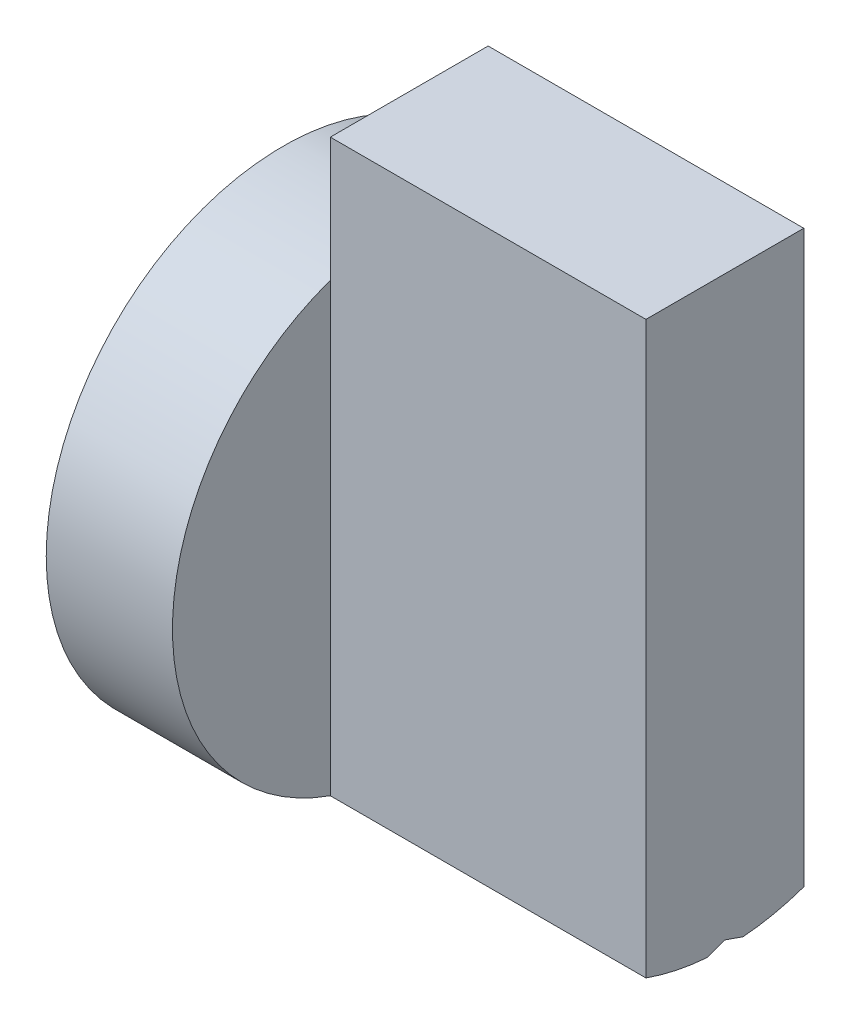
ISO-10303-21;
HEADER;
FILE_DESCRIPTION(('STEP AP214'),'2;1');
FILE_NAME('part.step','',(''),(''),'','','');
FILE_SCHEMA(('AUTOMOTIVE_DESIGN { 1 0 10303 214 1 1 1 1 }'));
ENDSEC;
DATA;
#1=APPLICATION_CONTEXT('core data for automotive mechanical design processes');
#2=APPLICATION_PROTOCOL_DEFINITION('international standard','automotive_design',2000,#1);
#3=PRODUCT_CONTEXT('',#1,'mechanical');
#4=PRODUCT('Part','Part','',(#3));
#5=PRODUCT_RELATED_PRODUCT_CATEGORY('part','',(#4));
#6=PRODUCT_DEFINITION_FORMATION('','',#4);
#7=PRODUCT_DEFINITION_CONTEXT('part definition',#1,'design');
#8=PRODUCT_DEFINITION('design','',#6,#7);
#9=PRODUCT_DEFINITION_SHAPE('','',#8);
#10=(LENGTH_UNIT() NAMED_UNIT(*) SI_UNIT(.MILLI.,.METRE.));
#11=(NAMED_UNIT(*) PLANE_ANGLE_UNIT() SI_UNIT($,.RADIAN.));
#12=(NAMED_UNIT(*) SI_UNIT($,.STERADIAN.) SOLID_ANGLE_UNIT());
#13=UNCERTAINTY_MEASURE_WITH_UNIT(LENGTH_MEASURE(1.E-05),#10,'distance_accuracy_value','');
#14=(GEOMETRIC_REPRESENTATION_CONTEXT(3) GLOBAL_UNCERTAINTY_ASSIGNED_CONTEXT((#13)) GLOBAL_UNIT_ASSIGNED_CONTEXT((#10,
#11,#12)) REPRESENTATION_CONTEXT('',''));
#15=CARTESIAN_POINT('',(0.,0.,0.));
#16=DIRECTION('',(0.,0.,1.));
#17=DIRECTION('',(1.,0.,0.));
#18=AXIS2_PLACEMENT_3D('',#15,#16,#17);
#19=CARTESIAN_POINT('',(0.,0.,0.));
#20=DIRECTION('',(1.,0.,0.));
#21=DIRECTION('',(0.,0.,-1.));
#22=AXIS2_PLACEMENT_3D('',#19,#20,#21);
#23=PLANE('',#22);
#24=CARTESIAN_POINT('',(0.,0.,0.));
#25=DIRECTION('',(1.,0.,0.));
#26=DIRECTION('',(0.,0.,-1.));
#27=AXIS2_PLACEMENT_3D('',#24,#25,#26);
#28=CIRCLE('',#27,7.5);
#29=CARTESIAN_POINT('',(0.,0.,-7.5));
#30=VERTEX_POINT('',#29);
#31=EDGE_CURVE('E165',#30,#30,#28,.T.);
#32=ORIENTED_EDGE('',*,*,#31,.F.);
#33=EDGE_LOOP('',(#32));
#34=FACE_BOUND('',#33,.T.);
#35=ADVANCED_FACE('F16',(#34),#23,.F.);
#36=CARTESIAN_POINT('',(4.,-7.276185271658,0.));
#37=DIRECTION('',(0.,-0.942885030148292,0.333118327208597));
#38=DIRECTION('',(0.,-0.333118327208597,-0.942885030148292));
#39=AXIS2_PLACEMENT_3D('',#36,#37,#38);
#40=PLANE('',#39);
#41=DIRECTION('',(1.,0.,0.));
#42=VECTOR('',#41,1.);
#43=CARTESIAN_POINT('',(4.,-7.27618527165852,-1.82254385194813E-13));
#44=LINE('',#43,#42);
#45=CARTESIAN_POINT('',(4.,-7.27618527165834,-1.21502923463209E-13));
#46=VERTEX_POINT('',#45);
#47=CARTESIAN_POINT('',(14.,-7.27618527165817,0.));
#48=VERTEX_POINT('',#47);
#49=EDGE_CURVE('E85',#46,#48,#44,.T.);
#50=ORIENTED_EDGE('',*,*,#49,.F.);
#51=DIRECTION('',(0.,0.333118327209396,0.94288503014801));
#52=VECTOR('',#51,1.);
#53=CARTESIAN_POINT('',(4.,-7.478176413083,-0.5717320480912));
#54=LINE('',#53,#52);
#55=CARTESIAN_POINT('',(4.,-7.47817641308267,-0.571732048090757));
#56=VERTEX_POINT('',#55);
#57=EDGE_CURVE('E95',#56,#46,#54,.T.);
#58=ORIENTED_EDGE('',*,*,#57,.F.);
#59=DIRECTION('',(1.,0.,0.));
#60=VECTOR('',#59,1.);
#61=CARTESIAN_POINT('',(0.,-7.47817641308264,-0.571732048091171));
#62=LINE('',#61,#60);
#63=CARTESIAN_POINT('',(14.,-7.47817641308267,-0.571732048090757));
#64=VERTEX_POINT('',#63);
#65=EDGE_CURVE('E101',#64,#56,#62,.F.);
#66=ORIENTED_EDGE('',*,*,#65,.F.);
#67=DIRECTION('',(0.,-0.333118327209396,-0.94288503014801));
#68=VECTOR('',#67,1.);
#69=CARTESIAN_POINT('',(14.,-7.276185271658,0.));
#70=LINE('',#69,#68);
#71=EDGE_CURVE('E98',#48,#64,#70,.T.);
#72=ORIENTED_EDGE('',*,*,#71,.F.);
#73=EDGE_LOOP('',(#50,#58,#66,#72));
#74=FACE_BOUND('',#73,.T.);
#75=ADVANCED_FACE('F99',(#74),#40,.T.);
#76=CARTESIAN_POINT('',(4.,0.,0.));
#77=DIRECTION('',(1.,0.,0.));
#78=DIRECTION('',(0.,0.,-1.));
#79=AXIS2_PLACEMENT_3D('',#76,#77,#78);
#80=PLANE('',#79);
#81=DIRECTION('',(0.,0.333118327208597,-0.942885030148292));
#82=VECTOR('',#81,1.);
#83=CARTESIAN_POINT('',(4.,-7.478176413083,0.5717320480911));
#84=LINE('',#83,#82);
#85=CARTESIAN_POINT('',(4.,-7.47817641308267,0.571732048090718));
#86=VERTEX_POINT('',#85);
#87=EDGE_CURVE('E92',#86,#46,#84,.T.);
#88=ORIENTED_EDGE('',*,*,#87,.F.);
#89=CARTESIAN_POINT('',(4.,0.,0.));
#90=DIRECTION('',(1.,0.,0.));
#91=DIRECTION('',(0.,0.,-1.));
#92=AXIS2_PLACEMENT_3D('',#89,#90,#91);
#93=CIRCLE('',#92,7.5);
#94=EDGE_CURVE('E146',#56,#86,#93,.F.);
#95=ORIENTED_EDGE('',*,*,#94,.F.);
#96=ORIENTED_EDGE('',*,*,#57,.T.);
#97=EDGE_LOOP('',(#88,#95,#96));
#98=FACE_BOUND('',#97,.T.);
#99=ADVANCED_FACE('F195',(#98),#80,.T.);
#100=CARTESIAN_POINT('',(4.,-7.478176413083,0.5717320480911));
#101=DIRECTION('',(0.,-0.942885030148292,-0.333118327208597));
#102=DIRECTION('',(0.,0.333118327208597,-0.942885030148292));
#103=AXIS2_PLACEMENT_3D('',#100,#101,#102);
#104=PLANE('',#103);
#105=DIRECTION('',(1.,0.,0.));
#106=VECTOR('',#105,1.);
#107=CARTESIAN_POINT('',(0.,-7.47817641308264,0.571732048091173));
#108=LINE('',#107,#106);
#109=CARTESIAN_POINT('',(14.,-7.47817641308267,0.571732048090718));
#110=VERTEX_POINT('',#109);
#111=EDGE_CURVE('E144',#86,#110,#108,.T.);
#112=ORIENTED_EDGE('',*,*,#111,.F.);
#113=ORIENTED_EDGE('',*,*,#87,.T.);
#114=ORIENTED_EDGE('',*,*,#49,.T.);
#115=DIRECTION('',(0.,0.333118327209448,-0.942885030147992));
#116=VECTOR('',#115,1.);
#117=CARTESIAN_POINT('',(14.,-7.478176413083,0.5717320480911));
#118=LINE('',#117,#116);
#119=EDGE_CURVE('E90',#110,#48,#118,.T.);
#120=ORIENTED_EDGE('',*,*,#119,.F.);
#121=EDGE_LOOP('',(#112,#113,#114,#120));
#122=FACE_BOUND('',#121,.T.);
#123=ADVANCED_FACE('F88',(#122),#104,.T.);
#124=CARTESIAN_POINT('',(4.,11.,2.5));
#125=DIRECTION('',(0.,0.,1.));
#126=DIRECTION('',(1.,0.,0.));
#127=AXIS2_PLACEMENT_3D('',#124,#125,#126);
#128=PLANE('',#127);
#129=DIRECTION('',(1.,0.,0.));
#130=VECTOR('',#129,1.);
#131=CARTESIAN_POINT('',(0.,-7.07106781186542,2.50000000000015));
#132=LINE('',#131,#130);
#133=CARTESIAN_POINT('',(14.,-7.07106781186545,2.50000000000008));
#134=VERTEX_POINT('',#133);
#135=CARTESIAN_POINT('',(4.,-7.07106781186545,2.50000000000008));
#136=VERTEX_POINT('',#135);
#137=EDGE_CURVE('E140',#134,#136,#132,.F.);
#138=ORIENTED_EDGE('',*,*,#137,.F.);
#139=DIRECTION('',(0.,1.,0.));
#140=VECTOR('',#139,1.);
#141=CARTESIAN_POINT('',(14.,0.,2.5));
#142=LINE('',#141,#140);
#143=CARTESIAN_POINT('',(14.,11.,2.5));
#144=VERTEX_POINT('',#143);
#145=EDGE_CURVE('E120',#144,#134,#142,.F.);
#146=ORIENTED_EDGE('',*,*,#145,.F.);
#147=DIRECTION('',(1.,0.,0.));
#148=VECTOR('',#147,1.);
#149=CARTESIAN_POINT('',(4.,11.,2.5));
#150=LINE('',#149,#148);
#151=CARTESIAN_POINT('',(4.,11.,2.5));
#152=VERTEX_POINT('',#151);
#153=EDGE_CURVE('E112',#152,#144,#150,.T.);
#154=ORIENTED_EDGE('',*,*,#153,.F.);
#155=DIRECTION('',(0.,1.,0.));
#156=VECTOR('',#155,1.);
#157=CARTESIAN_POINT('',(4.,0.,2.5));
#158=LINE('',#157,#156);
#159=CARTESIAN_POINT('',(4.,7.07106781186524,2.5));
#160=VERTEX_POINT('',#159);
#161=EDGE_CURVE('E132',#152,#160,#158,.F.);
#162=ORIENTED_EDGE('',*,*,#161,.T.);
#163=DIRECTION('',(0.,1.,0.));
#164=VECTOR('',#163,1.);
#165=CARTESIAN_POINT('',(4.,0.,2.5));
#166=LINE('',#165,#164);
#167=EDGE_CURVE('E137',#136,#160,#166,.T.);
#168=ORIENTED_EDGE('',*,*,#167,.F.);
#169=EDGE_LOOP('',(#138,#146,#154,#162,#168));
#170=FACE_BOUND('',#169,.T.);
#171=ADVANCED_FACE('F191',(#170),#128,.T.);
#172=CARTESIAN_POINT('',(4.,0.,0.));
#173=DIRECTION('',(1.,0.,0.));
#174=DIRECTION('',(0.,0.,-1.));
#175=AXIS2_PLACEMENT_3D('',#172,#173,#174);
#176=PLANE('',#175);
#177=CARTESIAN_POINT('',(4.,0.,0.));
#178=DIRECTION('',(1.,0.,0.));
#179=DIRECTION('',(0.,0.,-1.));
#180=AXIS2_PLACEMENT_3D('',#177,#178,#179);
#181=CIRCLE('',#180,7.5);
#182=EDGE_CURVE('E143',#136,#160,#181,.F.);
#183=ORIENTED_EDGE('',*,*,#182,.F.);
#184=ORIENTED_EDGE('',*,*,#167,.T.);
#185=EDGE_LOOP('',(#183,#184));
#186=FACE_BOUND('',#185,.T.);
#187=ADVANCED_FACE('F197',(#186),#176,.T.);
#188=CARTESIAN_POINT('',(4.,0.,0.));
#189=DIRECTION('',(1.,0.,0.));
#190=DIRECTION('',(0.,0.,-1.));
#191=AXIS2_PLACEMENT_3D('',#188,#189,#190);
#192=PLANE('',#191);
#193=DIRECTION('',(0.,0.,1.));
#194=VECTOR('',#193,1.);
#195=CARTESIAN_POINT('',(4.,11.,-2.5));
#196=LINE('',#195,#194);
#197=CARTESIAN_POINT('',(4.,11.,-2.5));
#198=VERTEX_POINT('',#197);
#199=EDGE_CURVE('E71',#198,#152,#196,.T.);
#200=ORIENTED_EDGE('',*,*,#199,.F.);
#201=DIRECTION('',(0.,1.,0.));
#202=VECTOR('',#201,1.);
#203=CARTESIAN_POINT('',(4.,-5.,-2.5));
#204=LINE('',#203,#202);
#205=CARTESIAN_POINT('',(4.,7.07106781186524,-2.5));
#206=VERTEX_POINT('',#205);
#207=EDGE_CURVE('E127',#206,#198,#204,.T.);
#208=ORIENTED_EDGE('',*,*,#207,.F.);
#209=CARTESIAN_POINT('',(4.,0.,0.));
#210=DIRECTION('',(1.,0.,0.));
#211=DIRECTION('',(0.,0.,-1.));
#212=AXIS2_PLACEMENT_3D('',#209,#210,#211);
#213=CIRCLE('',#212,7.5);
#214=EDGE_CURVE('E19',#160,#206,#213,.F.);
#215=ORIENTED_EDGE('',*,*,#214,.F.);
#216=ORIENTED_EDGE('',*,*,#161,.F.);
#217=EDGE_LOOP('',(#200,#208,#215,#216));
#218=FACE_BOUND('',#217,.T.);
#219=ADVANCED_FACE('F198',(#218),#192,.F.);
#220=CARTESIAN_POINT('',(4.,11.,-2.5));
#221=DIRECTION('',(0.,1.,0.));
#222=DIRECTION('',(0.,0.,1.));
#223=AXIS2_PLACEMENT_3D('',#220,#221,#222);
#224=PLANE('',#223);
#225=DIRECTION('',(-1.,0.,0.));
#226=VECTOR('',#225,1.);
#227=CARTESIAN_POINT('',(4.,11.,-2.5));
#228=LINE('',#227,#226);
#229=CARTESIAN_POINT('',(14.,11.,-2.5));
#230=VERTEX_POINT('',#229);
#231=EDGE_CURVE('E123',#198,#230,#228,.F.);
#232=ORIENTED_EDGE('',*,*,#231,.F.);
#233=ORIENTED_EDGE('',*,*,#199,.T.);
#234=ORIENTED_EDGE('',*,*,#153,.T.);
#235=DIRECTION('',(0.,0.,-1.));
#236=VECTOR('',#235,1.);
#237=CARTESIAN_POINT('',(14.,11.,0.));
#238=LINE('',#237,#236);
#239=EDGE_CURVE('E104',#230,#144,#238,.F.);
#240=ORIENTED_EDGE('',*,*,#239,.F.);
#241=EDGE_LOOP('',(#232,#233,#234,#240));
#242=FACE_BOUND('',#241,.T.);
#243=ADVANCED_FACE('F189',(#242),#224,.T.);
#244=CARTESIAN_POINT('',(14.,0.,0.));
#245=DIRECTION('',(1.,0.,0.));
#246=DIRECTION('',(0.,0.,-1.));
#247=AXIS2_PLACEMENT_3D('',#244,#245,#246);
#248=PLANE('',#247);
#249=ORIENTED_EDGE('',*,*,#239,.T.);
#250=ORIENTED_EDGE('',*,*,#145,.T.);
#251=CARTESIAN_POINT('',(14.,0.,0.));
#252=DIRECTION('',(1.,0.,0.));
#253=DIRECTION('',(0.,0.,-1.));
#254=AXIS2_PLACEMENT_3D('',#251,#252,#253);
#255=CIRCLE('',#254,7.5);
#256=EDGE_CURVE('E109',#110,#134,#255,.F.);
#257=ORIENTED_EDGE('',*,*,#256,.F.);
#258=ORIENTED_EDGE('',*,*,#119,.T.);
#259=ORIENTED_EDGE('',*,*,#71,.T.);
#260=CARTESIAN_POINT('',(14.,0.,0.));
#261=DIRECTION('',(1.,0.,0.));
#262=DIRECTION('',(0.,0.,-1.));
#263=AXIS2_PLACEMENT_3D('',#260,#261,#262);
#264=CIRCLE('',#263,7.5);
#265=CARTESIAN_POINT('',(14.,-7.07106781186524,-2.5));
#266=VERTEX_POINT('',#265);
#267=EDGE_CURVE('E154',#266,#64,#264,.F.);
#268=ORIENTED_EDGE('',*,*,#267,.F.);
#269=DIRECTION('',(0.,1.,0.));
#270=VECTOR('',#269,1.);
#271=CARTESIAN_POINT('',(14.,-5.,-2.5));
#272=LINE('',#271,#270);
#273=EDGE_CURVE('E126',#230,#266,#272,.F.);
#274=ORIENTED_EDGE('',*,*,#273,.F.);
#275=EDGE_LOOP('',(#249,#250,#257,#258,#259,#268,#274));
#276=FACE_BOUND('',#275,.T.);
#277=ADVANCED_FACE('F107',(#276),#248,.T.);
#278=CARTESIAN_POINT('',(0.,0.,0.));
#279=DIRECTION('',(1.,0.,0.));
#280=DIRECTION('',(0.,0.,-1.));
#281=AXIS2_PLACEMENT_3D('',#278,#279,#280);
#282=CYLINDRICAL_SURFACE('',#281,7.5);
#283=ORIENTED_EDGE('',*,*,#31,.T.);
#284=EDGE_LOOP('',(#283));
#285=FACE_BOUND('',#284,.T.);
#286=ORIENTED_EDGE('',*,*,#137,.T.);
#287=ORIENTED_EDGE('',*,*,#182,.T.);
#288=ORIENTED_EDGE('',*,*,#214,.T.);
#289=CARTESIAN_POINT('',(4.,0.,0.));
#290=DIRECTION('',(1.,0.,0.));
#291=DIRECTION('',(0.,0.,-1.));
#292=AXIS2_PLACEMENT_3D('',#289,#290,#291);
#293=CIRCLE('',#292,7.5);
#294=CARTESIAN_POINT('',(4.,-7.07106781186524,-2.5));
#295=VERTEX_POINT('',#294);
#296=EDGE_CURVE('E34',#295,#206,#293,.T.);
#297=ORIENTED_EDGE('',*,*,#296,.F.);
#298=DIRECTION('',(-1.,0.,0.));
#299=VECTOR('',#298,1.);
#300=CARTESIAN_POINT('',(4.,-7.071067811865,-2.5));
#301=LINE('',#300,#299);
#302=EDGE_CURVE('E25',#266,#295,#301,.T.);
#303=ORIENTED_EDGE('',*,*,#302,.F.);
#304=ORIENTED_EDGE('',*,*,#267,.T.);
#305=ORIENTED_EDGE('',*,*,#65,.T.);
#306=ORIENTED_EDGE('',*,*,#94,.T.);
#307=ORIENTED_EDGE('',*,*,#111,.T.);
#308=ORIENTED_EDGE('',*,*,#256,.T.);
#309=EDGE_LOOP('',(#286,#287,#288,#297,#303,#304,#305,#306,#307,#308));
#310=FACE_BOUND('',#309,.T.);
#311=ADVANCED_FACE('F187',(#285,#310),#282,.T.);
#312=CARTESIAN_POINT('',(4.,0.,0.));
#313=DIRECTION('',(1.,0.,0.));
#314=DIRECTION('',(0.,0.,-1.));
#315=AXIS2_PLACEMENT_3D('',#312,#313,#314);
#316=PLANE('',#315);
#317=ORIENTED_EDGE('',*,*,#296,.T.);
#318=DIRECTION('',(0.,1.,0.));
#319=VECTOR('',#318,1.);
#320=CARTESIAN_POINT('',(4.,-5.,-2.5));
#321=LINE('',#320,#319);
#322=EDGE_CURVE('E11',#295,#206,#321,.T.);
#323=ORIENTED_EDGE('',*,*,#322,.F.);
#324=EDGE_LOOP('',(#317,#323));
#325=FACE_BOUND('',#324,.T.);
#326=ADVANCED_FACE('F200',(#325),#316,.T.);
#327=CARTESIAN_POINT('',(4.,-5.,-2.5));
#328=DIRECTION('',(0.,0.,-1.));
#329=DIRECTION('',(-1.,0.,0.));
#330=AXIS2_PLACEMENT_3D('',#327,#328,#329);
#331=PLANE('',#330);
#332=ORIENTED_EDGE('',*,*,#302,.T.);
#333=ORIENTED_EDGE('',*,*,#322,.T.);
#334=ORIENTED_EDGE('',*,*,#207,.T.);
#335=ORIENTED_EDGE('',*,*,#231,.T.);
#336=ORIENTED_EDGE('',*,*,#273,.T.);
#337=EDGE_LOOP('',(#332,#333,#334,#335,#336));
#338=FACE_BOUND('',#337,.T.);
#339=ADVANCED_FACE('F185',(#338),#331,.T.);
#340=CLOSED_SHELL('',(#35,#75,#99,#123,#171,#187,#219,#243,#277,#311,#326,#339));
#341=MANIFOLD_SOLID_BREP('B1',#340);
#342=ADVANCED_BREP_SHAPE_REPRESENTATION('',(#18,#341),#14);
#343=SHAPE_DEFINITION_REPRESENTATION(#9,#342);
ENDSEC;
END-ISO-10303-21;
